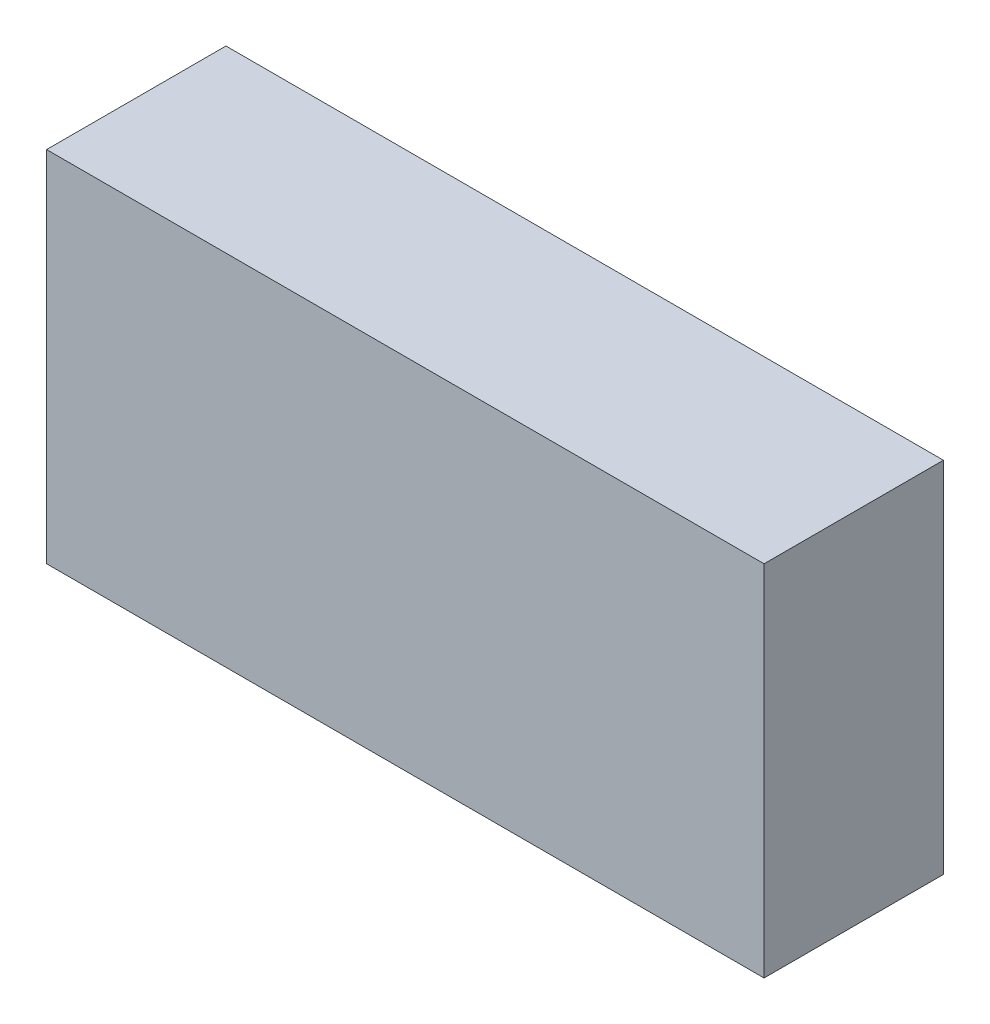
ISO-10303-21;
HEADER;
FILE_DESCRIPTION(('STEP AP214'),'2;1');
FILE_NAME('part.step','',(''),(''),'','','');
FILE_SCHEMA(('AUTOMOTIVE_DESIGN { 1 0 10303 214 1 1 1 1 }'));
ENDSEC;
DATA;
#1=APPLICATION_CONTEXT('core data for automotive mechanical design processes');
#2=APPLICATION_PROTOCOL_DEFINITION('international standard','automotive_design',2000,#1);
#3=PRODUCT_CONTEXT('',#1,'mechanical');
#4=PRODUCT('Part','Part','',(#3));
#5=PRODUCT_RELATED_PRODUCT_CATEGORY('part','',(#4));
#6=PRODUCT_DEFINITION_FORMATION('','',#4);
#7=PRODUCT_DEFINITION_CONTEXT('part definition',#1,'design');
#8=PRODUCT_DEFINITION('design','',#6,#7);
#9=PRODUCT_DEFINITION_SHAPE('','',#8);
#10=(LENGTH_UNIT() NAMED_UNIT(*) SI_UNIT(.MILLI.,.METRE.));
#11=(NAMED_UNIT(*) PLANE_ANGLE_UNIT() SI_UNIT($,.RADIAN.));
#12=(NAMED_UNIT(*) SI_UNIT($,.STERADIAN.) SOLID_ANGLE_UNIT());
#13=UNCERTAINTY_MEASURE_WITH_UNIT(LENGTH_MEASURE(1.E-05),#10,'distance_accuracy_value','');
#14=(GEOMETRIC_REPRESENTATION_CONTEXT(3) GLOBAL_UNCERTAINTY_ASSIGNED_CONTEXT((#13)) GLOBAL_UNIT_ASSIGNED_CONTEXT((#10,
#11,#12)) REPRESENTATION_CONTEXT('',''));
#15=CARTESIAN_POINT('',(0.,0.,0.));
#16=DIRECTION('',(0.,0.,1.));
#17=DIRECTION('',(1.,0.,0.));
#18=AXIS2_PLACEMENT_3D('',#15,#16,#17);
#19=CARTESIAN_POINT('',(6.35,-3.175,3.175));
#20=DIRECTION('',(-1.,0.,0.));
#21=DIRECTION('',(0.,0.,1.));
#22=AXIS2_PLACEMENT_3D('',#19,#20,#21);
#23=PLANE('',#22);
#24=DIRECTION('',(0.,1.,0.));
#25=VECTOR('',#24,1.);
#26=CARTESIAN_POINT('',(6.35,-3.175,0.));
#27=LINE('',#26,#25);
#28=CARTESIAN_POINT('',(6.35,-3.175,0.));
#29=VERTEX_POINT('',#28);
#30=CARTESIAN_POINT('',(6.35,3.175,0.));
#31=VERTEX_POINT('',#30);
#32=EDGE_CURVE('E96',#29,#31,#27,.T.);
#33=ORIENTED_EDGE('',*,*,#32,.T.);
#34=DIRECTION('',(0.,0.,-1.));
#35=VECTOR('',#34,1.);
#36=CARTESIAN_POINT('',(6.35,3.175,3.175));
#37=LINE('',#36,#35);
#38=CARTESIAN_POINT('',(6.35,3.175,3.175));
#39=VERTEX_POINT('',#38);
#40=EDGE_CURVE('E11',#39,#31,#37,.T.);
#41=ORIENTED_EDGE('',*,*,#40,.F.);
#42=DIRECTION('',(0.,1.,0.));
#43=VECTOR('',#42,1.);
#44=CARTESIAN_POINT('',(6.35,-3.175,3.175));
#45=LINE('',#44,#43);
#46=CARTESIAN_POINT('',(6.35,-3.175,3.175));
#47=VERTEX_POINT('',#46);
#48=EDGE_CURVE('E84',#47,#39,#45,.T.);
#49=ORIENTED_EDGE('',*,*,#48,.F.);
#50=DIRECTION('',(0.,0.,-1.));
#51=VECTOR('',#50,1.);
#52=CARTESIAN_POINT('',(6.35,-3.175,3.175));
#53=LINE('',#52,#51);
#54=EDGE_CURVE('E92',#47,#29,#53,.T.);
#55=ORIENTED_EDGE('',*,*,#54,.T.);
#56=EDGE_LOOP('',(#33,#41,#49,#55));
#57=FACE_BOUND('',#56,.T.);
#58=ADVANCED_FACE('F33',(#57),#23,.F.);
#59=CARTESIAN_POINT('',(-6.35,3.175,3.175));
#60=DIRECTION('',(0.,-1.,0.));
#61=DIRECTION('',(0.,0.,-1.));
#62=AXIS2_PLACEMENT_3D('',#59,#60,#61);
#63=PLANE('',#62);
#64=DIRECTION('',(-1.,0.,0.));
#65=VECTOR('',#64,1.);
#66=CARTESIAN_POINT('',(-6.35,3.175,0.));
#67=LINE('',#66,#65);
#68=CARTESIAN_POINT('',(-6.35,3.175,0.));
#69=VERTEX_POINT('',#68);
#70=EDGE_CURVE('E88',#31,#69,#67,.T.);
#71=ORIENTED_EDGE('',*,*,#70,.T.);
#72=DIRECTION('',(0.,0.,-1.));
#73=VECTOR('',#72,1.);
#74=CARTESIAN_POINT('',(-6.35,3.175,3.175));
#75=LINE('',#74,#73);
#76=CARTESIAN_POINT('',(-6.35,3.175,3.175));
#77=VERTEX_POINT('',#76);
#78=EDGE_CURVE('E41',#77,#69,#75,.T.);
#79=ORIENTED_EDGE('',*,*,#78,.F.);
#80=DIRECTION('',(-1.,0.,0.));
#81=VECTOR('',#80,1.);
#82=CARTESIAN_POINT('',(-6.35,3.175,3.175));
#83=LINE('',#82,#81);
#84=EDGE_CURVE('E79',#39,#77,#83,.T.);
#85=ORIENTED_EDGE('',*,*,#84,.F.);
#86=ORIENTED_EDGE('',*,*,#40,.T.);
#87=EDGE_LOOP('',(#71,#79,#85,#86));
#88=FACE_BOUND('',#87,.T.);
#89=ADVANCED_FACE('F87',(#88),#63,.F.);
#90=CARTESIAN_POINT('',(-6.35,-3.175,3.175));
#91=DIRECTION('',(1.,0.,0.));
#92=DIRECTION('',(0.,0.,-1.));
#93=AXIS2_PLACEMENT_3D('',#90,#91,#92);
#94=PLANE('',#93);
#95=DIRECTION('',(0.,-1.,0.));
#96=VECTOR('',#95,1.);
#97=CARTESIAN_POINT('',(-6.35,-3.175,0.));
#98=LINE('',#97,#96);
#99=CARTESIAN_POINT('',(-6.35,-3.175,0.));
#100=VERTEX_POINT('',#99);
#101=EDGE_CURVE('E66',#69,#100,#98,.T.);
#102=ORIENTED_EDGE('',*,*,#101,.T.);
#103=DIRECTION('',(0.,0.,-1.));
#104=VECTOR('',#103,1.);
#105=CARTESIAN_POINT('',(-6.35,-3.175,3.175));
#106=LINE('',#105,#104);
#107=CARTESIAN_POINT('',(-6.35,-3.175,3.175));
#108=VERTEX_POINT('',#107);
#109=EDGE_CURVE('E89',#108,#100,#106,.T.);
#110=ORIENTED_EDGE('',*,*,#109,.F.);
#111=DIRECTION('',(0.,-1.,0.));
#112=VECTOR('',#111,1.);
#113=CARTESIAN_POINT('',(-6.35,-3.175,3.175));
#114=LINE('',#113,#112);
#115=EDGE_CURVE('E82',#77,#108,#114,.T.);
#116=ORIENTED_EDGE('',*,*,#115,.F.);
#117=ORIENTED_EDGE('',*,*,#78,.T.);
#118=EDGE_LOOP('',(#102,#110,#116,#117));
#119=FACE_BOUND('',#118,.T.);
#120=ADVANCED_FACE('F90',(#119),#94,.F.);
#121=CARTESIAN_POINT('',(-6.35,-3.175,3.175));
#122=DIRECTION('',(0.,1.,0.));
#123=DIRECTION('',(0.,0.,1.));
#124=AXIS2_PLACEMENT_3D('',#121,#122,#123);
#125=PLANE('',#124);
#126=DIRECTION('',(1.,0.,0.));
#127=VECTOR('',#126,1.);
#128=CARTESIAN_POINT('',(-6.35,-3.175,0.));
#129=LINE('',#128,#127);
#130=EDGE_CURVE('E72',#100,#29,#129,.T.);
#131=ORIENTED_EDGE('',*,*,#130,.T.);
#132=ORIENTED_EDGE('',*,*,#54,.F.);
#133=DIRECTION('',(1.,0.,0.));
#134=VECTOR('',#133,1.);
#135=CARTESIAN_POINT('',(-6.35,-3.175,3.175));
#136=LINE('',#135,#134);
#137=EDGE_CURVE('E49',#108,#47,#136,.T.);
#138=ORIENTED_EDGE('',*,*,#137,.F.);
#139=ORIENTED_EDGE('',*,*,#109,.T.);
#140=EDGE_LOOP('',(#131,#132,#138,#139));
#141=FACE_BOUND('',#140,.T.);
#142=ADVANCED_FACE('F103',(#141),#125,.F.);
#143=CARTESIAN_POINT('',(6.35,3.175,3.175));
#144=DIRECTION('',(0.,0.,-1.));
#145=DIRECTION('',(-1.,0.,0.));
#146=AXIS2_PLACEMENT_3D('',#143,#144,#145);
#147=PLANE('',#146);
#148=ORIENTED_EDGE('',*,*,#48,.T.);
#149=ORIENTED_EDGE('',*,*,#84,.T.);
#150=ORIENTED_EDGE('',*,*,#115,.T.);
#151=ORIENTED_EDGE('',*,*,#137,.T.);
#152=EDGE_LOOP('',(#148,#149,#150,#151));
#153=FACE_BOUND('',#152,.T.);
#154=ADVANCED_FACE('F80',(#153),#147,.F.);
#155=CARTESIAN_POINT('',(6.35,3.175,0.));
#156=DIRECTION('',(0.,0.,-1.));
#157=DIRECTION('',(-1.,0.,0.));
#158=AXIS2_PLACEMENT_3D('',#155,#156,#157);
#159=PLANE('',#158);
#160=ORIENTED_EDGE('',*,*,#32,.F.);
#161=ORIENTED_EDGE('',*,*,#130,.F.);
#162=ORIENTED_EDGE('',*,*,#101,.F.);
#163=ORIENTED_EDGE('',*,*,#70,.F.);
#164=EDGE_LOOP('',(#160,#161,#162,#163));
#165=FACE_BOUND('',#164,.T.);
#166=ADVANCED_FACE('F106',(#165),#159,.T.);
#167=CLOSED_SHELL('',(#58,#89,#120,#142,#154,#166));
#168=MANIFOLD_SOLID_BREP('B2',#167);
#169=ADVANCED_BREP_SHAPE_REPRESENTATION('',(#18,#168),#14);
#170=SHAPE_DEFINITION_REPRESENTATION(#9,#169);
ENDSEC;
END-ISO-10303-21;
